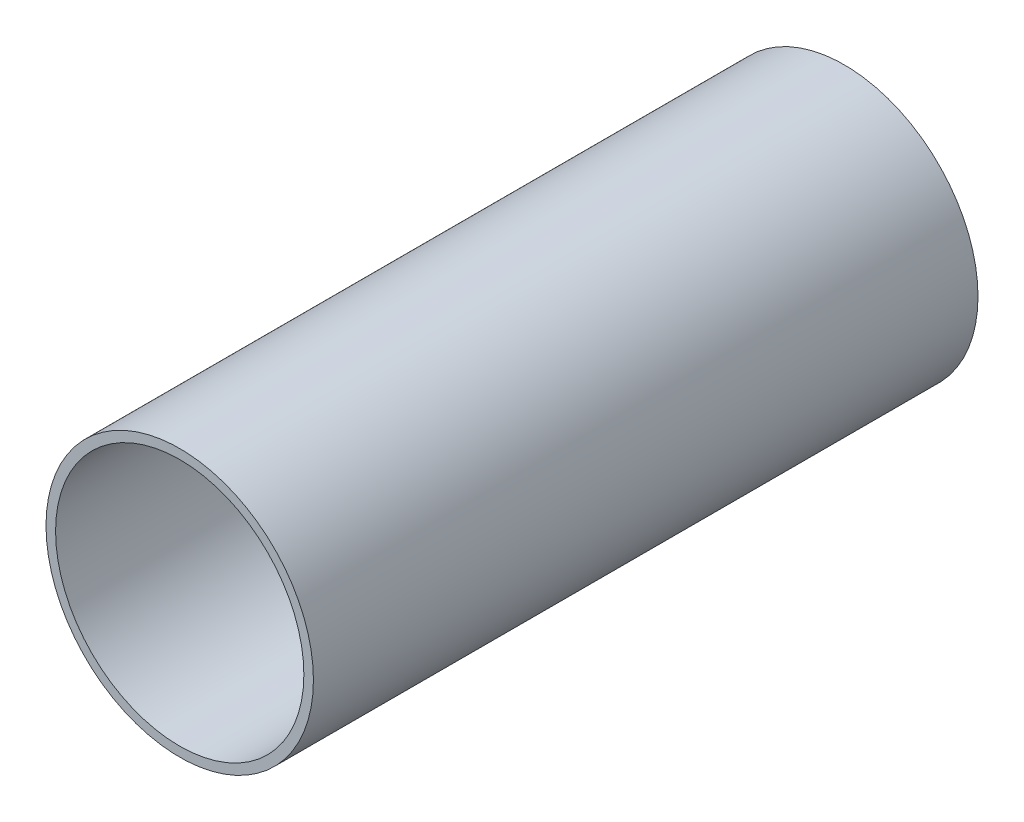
ISO-10303-21;
HEADER;
FILE_DESCRIPTION(('STEP AP214'),'2;1');
FILE_NAME('part.step','',(''),(''),'','','');
FILE_SCHEMA(('AUTOMOTIVE_DESIGN { 1 0 10303 214 1 1 1 1 }'));
ENDSEC;
DATA;
#1=APPLICATION_CONTEXT('core data for automotive mechanical design processes');
#2=APPLICATION_PROTOCOL_DEFINITION('international standard','automotive_design',2000,#1);
#3=PRODUCT_CONTEXT('',#1,'mechanical');
#4=PRODUCT('Part','Part','',(#3));
#5=PRODUCT_RELATED_PRODUCT_CATEGORY('part','',(#4));
#6=PRODUCT_DEFINITION_FORMATION('','',#4);
#7=PRODUCT_DEFINITION_CONTEXT('part definition',#1,'design');
#8=PRODUCT_DEFINITION('design','',#6,#7);
#9=PRODUCT_DEFINITION_SHAPE('','',#8);
#10=(LENGTH_UNIT() NAMED_UNIT(*) SI_UNIT(.MILLI.,.METRE.));
#11=(NAMED_UNIT(*) PLANE_ANGLE_UNIT() SI_UNIT($,.RADIAN.));
#12=(NAMED_UNIT(*) SI_UNIT($,.STERADIAN.) SOLID_ANGLE_UNIT());
#13=UNCERTAINTY_MEASURE_WITH_UNIT(LENGTH_MEASURE(1.E-05),#10,'distance_accuracy_value','');
#14=(GEOMETRIC_REPRESENTATION_CONTEXT(3) GLOBAL_UNCERTAINTY_ASSIGNED_CONTEXT((#13)) GLOBAL_UNIT_ASSIGNED_CONTEXT((#10,
#11,#12)) REPRESENTATION_CONTEXT('',''));
#15=CARTESIAN_POINT('',(0.,0.,0.));
#16=DIRECTION('',(0.,0.,1.));
#17=DIRECTION('',(1.,0.,0.));
#18=AXIS2_PLACEMENT_3D('',#15,#16,#17);
#19=CARTESIAN_POINT('',(0.,0.,250.));
#20=DIRECTION('',(0.,0.,1.));
#21=DIRECTION('',(1.,0.,0.));
#22=AXIS2_PLACEMENT_3D('',#19,#20,#21);
#23=PLANE('',#22);
#24=CARTESIAN_POINT('',(0.,0.,250.));
#25=DIRECTION('',(0.,0.,1.));
#26=DIRECTION('',(1.,0.,0.));
#27=AXIS2_PLACEMENT_3D('',#24,#25,#26);
#28=CIRCLE('',#27,50.3);
#29=CARTESIAN_POINT('',(50.3,0.,250.));
#30=VERTEX_POINT('',#29);
#31=EDGE_CURVE('E10',#30,#30,#28,.T.);
#32=ORIENTED_EDGE('',*,*,#31,.T.);
#33=EDGE_LOOP('',(#32));
#34=FACE_BOUND('',#33,.T.);
#35=CARTESIAN_POINT('',(0.,0.,250.));
#36=DIRECTION('',(0.,0.,1.));
#37=DIRECTION('',(1.,0.,0.));
#38=AXIS2_PLACEMENT_3D('',#35,#36,#37);
#39=CIRCLE('',#38,46.7);
#40=CARTESIAN_POINT('',(46.7,0.,250.));
#41=VERTEX_POINT('',#40);
#42=EDGE_CURVE('E41',#41,#41,#39,.T.);
#43=ORIENTED_EDGE('',*,*,#42,.F.);
#44=EDGE_LOOP('',(#43));
#45=FACE_BOUND('',#44,.T.);
#46=ADVANCED_FACE('F30',(#34,#45),#23,.T.);
#47=CARTESIAN_POINT('',(0.,0.,0.));
#48=DIRECTION('',(0.,0.,1.));
#49=DIRECTION('',(1.,0.,0.));
#50=AXIS2_PLACEMENT_3D('',#47,#48,#49);
#51=PLANE('',#50);
#52=CARTESIAN_POINT('',(0.,0.,0.));
#53=DIRECTION('',(0.,0.,1.));
#54=DIRECTION('',(1.,0.,0.));
#55=AXIS2_PLACEMENT_3D('',#52,#53,#54);
#56=CIRCLE('',#55,50.3);
#57=CARTESIAN_POINT('',(50.3,0.,0.));
#58=VERTEX_POINT('',#57);
#59=EDGE_CURVE('E37',#58,#58,#56,.T.);
#60=ORIENTED_EDGE('',*,*,#59,.F.);
#61=EDGE_LOOP('',(#60));
#62=FACE_BOUND('',#61,.T.);
#63=CARTESIAN_POINT('',(0.,0.,0.));
#64=DIRECTION('',(0.,0.,1.));
#65=DIRECTION('',(1.,0.,0.));
#66=AXIS2_PLACEMENT_3D('',#63,#64,#65);
#67=CIRCLE('',#66,46.7);
#68=CARTESIAN_POINT('',(46.7,0.,0.));
#69=VERTEX_POINT('',#68);
#70=EDGE_CURVE('E45',#69,#69,#67,.T.);
#71=ORIENTED_EDGE('',*,*,#70,.T.);
#72=EDGE_LOOP('',(#71));
#73=FACE_BOUND('',#72,.T.);
#74=ADVANCED_FACE('F51',(#62,#73),#51,.F.);
#75=CARTESIAN_POINT('',(0.,0.,250.));
#76=DIRECTION('',(0.,0.,-1.));
#77=DIRECTION('',(-1.,0.,0.));
#78=AXIS2_PLACEMENT_3D('',#75,#76,#77);
#79=CYLINDRICAL_SURFACE('',#78,50.3);
#80=ORIENTED_EDGE('',*,*,#31,.F.);
#81=EDGE_LOOP('',(#80));
#82=FACE_BOUND('',#81,.T.);
#83=ORIENTED_EDGE('',*,*,#59,.T.);
#84=EDGE_LOOP('',(#83));
#85=FACE_BOUND('',#84,.T.);
#86=ADVANCED_FACE('F32',(#82,#85),#79,.T.);
#87=CARTESIAN_POINT('',(0.,0.,250.));
#88=DIRECTION('',(0.,0.,-1.));
#89=DIRECTION('',(-1.,0.,0.));
#90=AXIS2_PLACEMENT_3D('',#87,#88,#89);
#91=CYLINDRICAL_SURFACE('',#90,46.7);
#92=ORIENTED_EDGE('',*,*,#42,.T.);
#93=EDGE_LOOP('',(#92));
#94=FACE_BOUND('',#93,.T.);
#95=ORIENTED_EDGE('',*,*,#70,.F.);
#96=EDGE_LOOP('',(#95));
#97=FACE_BOUND('',#96,.T.);
#98=ADVANCED_FACE('F53',(#94,#97),#91,.F.);
#99=CLOSED_SHELL('',(#46,#74,#86,#98));
#100=MANIFOLD_SOLID_BREP('B2',#99);
#101=ADVANCED_BREP_SHAPE_REPRESENTATION('',(#18,#100),#14);
#102=SHAPE_DEFINITION_REPRESENTATION(#9,#101);
ENDSEC;
END-ISO-10303-21;
